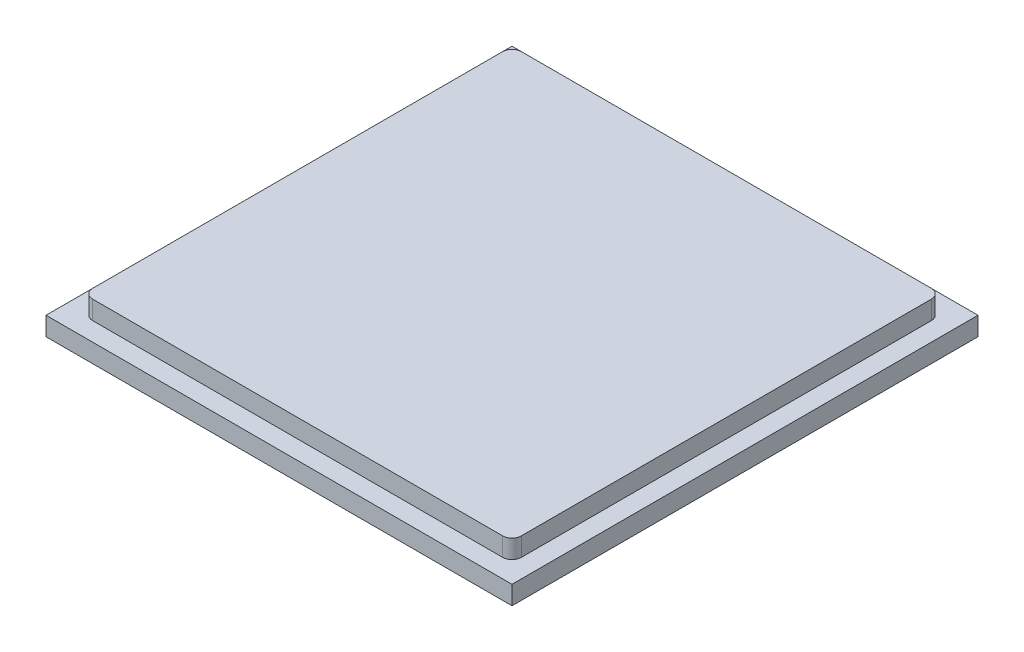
from build123d import *

# Parameters (mm, degrees)
SKETCH2_W           = 63.5
SKETCH2_H           = 63.5
BOSS_EXTRUDE2_DEPTH = 2.54
BOSS_EXTRUDE3_DEPTH = 2.54


with BuildPart() as part:
    # Sketch2 → Boss-Extrude2 (new body)
    with BuildSketch(Plane(origin=(0, 0, 0), x_dir=(1, 0, 0), z_dir=(0, 1, 0))):
        with Locations((31.75, 31.75)):
            Rectangle(SKETCH2_W, SKETCH2_H)
    extrude(amount=BOSS_EXTRUDE2_DEPTH)

    # Sketch3 → Boss-Extrude3 (add)
    with BuildSketch(Plane(origin=(0, 2.54, 0), x_dir=(1, 0, 0), z_dir=(0, 1, 0))):
        with BuildLine():
            ThreePointArc((2.54, 59.69), (2.911974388, 60.588025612), (3.81, 60.96))
            Line((3.81, 60.96), (59.69, 60.96))
            ThreePointArc((59.69, 60.96), (60.588025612, 60.588025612), (60.96, 59.69))
            Line((60.96, 59.69), (60.96, 3.81))
            ThreePointArc((60.96, 3.81), (60.588025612, 2.911974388), (59.69, 2.54))
            Line((59.69, 2.54), (3.81, 2.54))
            ThreePointArc((3.81, 2.54), (2.911974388, 2.911974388), (2.54, 3.81))
            Line((2.54, 3.81), (2.54, 59.69))
        make_face()
    extrude(amount=BOSS_EXTRUDE3_DEPTH)


solid = part.part
